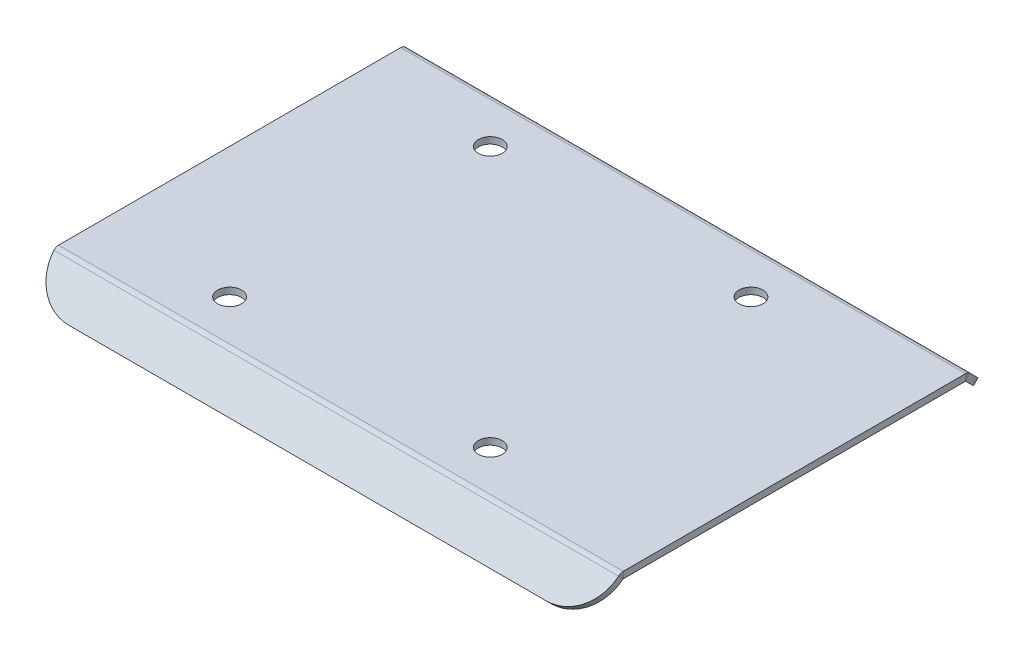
ISO-10303-21;
HEADER;
FILE_DESCRIPTION(('STEP AP214'),'2;1');
FILE_NAME('part.step','',(''),(''),'','','');
FILE_SCHEMA(('AUTOMOTIVE_DESIGN { 1 0 10303 214 1 1 1 1 }'));
ENDSEC;
DATA;
#1=APPLICATION_CONTEXT('core data for automotive mechanical design processes');
#2=APPLICATION_PROTOCOL_DEFINITION('international standard','automotive_design',2000,#1);
#3=PRODUCT_CONTEXT('',#1,'mechanical');
#4=PRODUCT('Part','Part','',(#3));
#5=PRODUCT_RELATED_PRODUCT_CATEGORY('part','',(#4));
#6=PRODUCT_DEFINITION_FORMATION('','',#4);
#7=PRODUCT_DEFINITION_CONTEXT('part definition',#1,'design');
#8=PRODUCT_DEFINITION('design','',#6,#7);
#9=PRODUCT_DEFINITION_SHAPE('','',#8);
#10=(LENGTH_UNIT() NAMED_UNIT(*) SI_UNIT(.MILLI.,.METRE.));
#11=(NAMED_UNIT(*) PLANE_ANGLE_UNIT() SI_UNIT($,.RADIAN.));
#12=(NAMED_UNIT(*) SI_UNIT($,.STERADIAN.) SOLID_ANGLE_UNIT());
#13=UNCERTAINTY_MEASURE_WITH_UNIT(LENGTH_MEASURE(1.E-05),#10,'distance_accuracy_value','');
#14=(GEOMETRIC_REPRESENTATION_CONTEXT(3) GLOBAL_UNCERTAINTY_ASSIGNED_CONTEXT((#13)) GLOBAL_UNIT_ASSIGNED_CONTEXT((#10,
#11,#12)) REPRESENTATION_CONTEXT('',''));
#15=CARTESIAN_POINT('',(0.,0.,0.));
#16=DIRECTION('',(0.,0.,1.));
#17=DIRECTION('',(1.,0.,0.));
#18=AXIS2_PLACEMENT_3D('',#15,#16,#17);
#19=CARTESIAN_POINT('',(130.,1.5,-9.26230100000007));
#20=DIRECTION('',(-1.,0.,0.));
#21=DIRECTION('',(0.,0.,1.));
#22=AXIS2_PLACEMENT_3D('',#19,#20,#21);
#23=PLANE('',#22);
#24=DIRECTION('',(0.,0.,-1.));
#25=VECTOR('',#24,1.);
#26=CARTESIAN_POINT('',(130.,1.5,-9.26230100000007));
#27=LINE('',#26,#25);
#28=CARTESIAN_POINT('',(130.,1.49999999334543,-9.88276347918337));
#29=VERTEX_POINT('',#28);
#30=CARTESIAN_POINT('',(130.,1.5,-88.6418385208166));
#31=VERTEX_POINT('',#30);
#32=EDGE_CURVE('E527',#29,#31,#27,.T.);
#33=ORIENTED_EDGE('',*,*,#32,.F.);
#34=DIRECTION('',(0.,-1.,0.));
#35=VECTOR('',#34,1.);
#36=CARTESIAN_POINT('',(130.,1.5,-9.88276347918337));
#37=LINE('',#36,#35);
#38=CARTESIAN_POINT('',(130.,0.,-9.88276347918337));
#39=VERTEX_POINT('',#38);
#40=EDGE_CURVE('E12',#29,#39,#37,.T.);
#41=ORIENTED_EDGE('',*,*,#40,.T.);
#42=DIRECTION('',(0.,0.,-1.));
#43=VECTOR('',#42,1.);
#44=CARTESIAN_POINT('',(130.,0.,-9.26230100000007));
#45=LINE('',#44,#43);
#46=CARTESIAN_POINT('',(130.,0.,-88.6418385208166));
#47=VERTEX_POINT('',#46);
#48=EDGE_CURVE('E591',#39,#47,#45,.T.);
#49=ORIENTED_EDGE('',*,*,#48,.T.);
#50=DIRECTION('',(0.,-1.,0.));
#51=VECTOR('',#50,1.);
#52=CARTESIAN_POINT('',(130.,1.5,-88.6418385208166));
#53=LINE('',#52,#51);
#54=EDGE_CURVE('E526',#31,#47,#53,.T.);
#55=ORIENTED_EDGE('',*,*,#54,.F.);
#56=EDGE_LOOP('',(#33,#41,#49,#55));
#57=FACE_BOUND('',#56,.T.);
#58=ADVANCED_FACE('F66',(#57),#23,.F.);
#59=CARTESIAN_POINT('',(0.,1.5,-89.2623009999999));
#60=DIRECTION('',(1.,0.,0.));
#61=DIRECTION('',(0.,0.,-1.));
#62=AXIS2_PLACEMENT_3D('',#59,#60,#61);
#63=PLANE('',#62);
#64=DIRECTION('',(0.,0.,1.));
#65=VECTOR('',#64,1.);
#66=CARTESIAN_POINT('',(0.,0.,-89.2623009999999));
#67=LINE('',#66,#65);
#68=CARTESIAN_POINT('',(0.,0.,-88.6418385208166));
#69=VERTEX_POINT('',#68);
#70=CARTESIAN_POINT('',(0.,-6.91786580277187E-09,-9.88276347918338));
#71=VERTEX_POINT('',#70);
#72=EDGE_CURVE('E93',#69,#71,#67,.T.);
#73=ORIENTED_EDGE('',*,*,#72,.T.);
#74=DIRECTION('',(0.,1.,0.));
#75=VECTOR('',#74,1.);
#76=CARTESIAN_POINT('',(0.,1.5,-9.88276347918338));
#77=LINE('',#76,#75);
#78=CARTESIAN_POINT('',(0.,1.49999999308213,-9.88276347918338));
#79=VERTEX_POINT('',#78);
#80=EDGE_CURVE('E587',#71,#79,#77,.T.);
#81=ORIENTED_EDGE('',*,*,#80,.T.);
#82=DIRECTION('',(0.,0.,1.));
#83=VECTOR('',#82,1.);
#84=CARTESIAN_POINT('',(0.,1.5,-89.2623009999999));
#85=LINE('',#84,#83);
#86=CARTESIAN_POINT('',(0.,1.50000005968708,-88.6418385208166));
#87=VERTEX_POINT('',#86);
#88=EDGE_CURVE('E593',#87,#79,#85,.T.);
#89=ORIENTED_EDGE('',*,*,#88,.F.);
#90=DIRECTION('',(0.,1.,0.));
#91=VECTOR('',#90,1.);
#92=CARTESIAN_POINT('',(0.,1.5,-88.6418385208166));
#93=LINE('',#92,#91);
#94=EDGE_CURVE('E532',#69,#87,#93,.T.);
#95=ORIENTED_EDGE('',*,*,#94,.F.);
#96=EDGE_LOOP('',(#73,#81,#89,#95));
#97=FACE_BOUND('',#96,.T.);
#98=ADVANCED_FACE('F633',(#97),#63,.F.);
#99=CARTESIAN_POINT('',(9.99999999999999,1.5,-89.262301));
#100=DIRECTION('',(0.,-1.,0.));
#101=DIRECTION('',(0.,0.,-1.));
#102=AXIS2_PLACEMENT_3D('',#99,#100,#101);
#103=PLANE('',#102);
#104=CARTESIAN_POINT('',(90.,1.5,-19.262301));
#105=DIRECTION('',(0.,1.,0.));
#106=DIRECTION('',(0.,0.,1.));
#107=AXIS2_PLACEMENT_3D('',#104,#105,#106);
#108=CIRCLE('',#107,2.75000000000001);
#109=CARTESIAN_POINT('',(90.,1.5,-16.512301));
#110=VERTEX_POINT('',#109);
#111=EDGE_CURVE('E502',#110,#110,#108,.T.);
#112=ORIENTED_EDGE('',*,*,#111,.F.);
#113=EDGE_LOOP('',(#112));
#114=FACE_BOUND('',#113,.T.);
#115=CARTESIAN_POINT('',(90.,1.5,-79.262301));
#116=DIRECTION('',(0.,1.,0.));
#117=DIRECTION('',(0.,0.,1.));
#118=AXIS2_PLACEMENT_3D('',#115,#116,#117);
#119=CIRCLE('',#118,2.75000000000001);
#120=CARTESIAN_POINT('',(90.,1.5,-76.512301));
#121=VERTEX_POINT('',#120);
#122=EDGE_CURVE('E514',#121,#121,#119,.T.);
#123=ORIENTED_EDGE('',*,*,#122,.F.);
#124=EDGE_LOOP('',(#123));
#125=FACE_BOUND('',#124,.T.);
#126=CARTESIAN_POINT('',(30.,1.5,-79.262301));
#127=DIRECTION('',(0.,1.,0.));
#128=DIRECTION('',(0.,0.,1.));
#129=AXIS2_PLACEMENT_3D('',#126,#127,#128);
#130=CIRCLE('',#129,2.75);
#131=CARTESIAN_POINT('',(30.,1.5,-76.512301));
#132=VERTEX_POINT('',#131);
#133=EDGE_CURVE('E520',#132,#132,#130,.T.);
#134=ORIENTED_EDGE('',*,*,#133,.F.);
#135=EDGE_LOOP('',(#134));
#136=FACE_BOUND('',#135,.T.);
#137=CARTESIAN_POINT('',(30.,1.5,-19.262301));
#138=DIRECTION('',(0.,1.,0.));
#139=DIRECTION('',(0.,0.,1.));
#140=AXIS2_PLACEMENT_3D('',#137,#138,#139);
#141=CIRCLE('',#140,2.75);
#142=CARTESIAN_POINT('',(30.,1.5,-16.512301));
#143=VERTEX_POINT('',#142);
#144=EDGE_CURVE('E508',#143,#143,#141,.T.);
#145=ORIENTED_EDGE('',*,*,#144,.F.);
#146=EDGE_LOOP('',(#145));
#147=FACE_BOUND('',#146,.T.);
#148=ORIENTED_EDGE('',*,*,#88,.T.);
#149=DIRECTION('',(1.,0.,0.));
#150=VECTOR('',#149,1.);
#151=CARTESIAN_POINT('',(9.99999999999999,1.5,-9.88276347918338));
#152=LINE('',#151,#150);
#153=EDGE_CURVE('E535',#79,#29,#152,.T.);
#154=ORIENTED_EDGE('',*,*,#153,.T.);
#155=ORIENTED_EDGE('',*,*,#32,.T.);
#156=DIRECTION('',(1.,0.,0.));
#157=VECTOR('',#156,1.);
#158=CARTESIAN_POINT('',(9.99999999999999,1.5,-88.6418385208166));
#159=LINE('',#158,#157);
#160=EDGE_CURVE('E523',#87,#31,#159,.T.);
#161=ORIENTED_EDGE('',*,*,#160,.F.);
#162=EDGE_LOOP('',(#148,#154,#155,#161));
#163=FACE_BOUND('',#162,.T.);
#164=ADVANCED_FACE('F639',(#114,#125,#136,#147,#163),#103,.F.);
#165=CARTESIAN_POINT('',(9.99999999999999,0.,-89.262301));
#166=DIRECTION('',(0.,-1.,0.));
#167=DIRECTION('',(0.,0.,-1.));
#168=AXIS2_PLACEMENT_3D('',#165,#166,#167);
#169=PLANE('',#168);
#170=DIRECTION('',(1.,0.,0.));
#171=VECTOR('',#170,1.);
#172=CARTESIAN_POINT('',(9.99999999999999,0.,-9.88276347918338));
#173=LINE('',#172,#171);
#174=EDGE_CURVE('E77',#71,#39,#173,.T.);
#175=ORIENTED_EDGE('',*,*,#174,.F.);
#176=ORIENTED_EDGE('',*,*,#72,.F.);
#177=DIRECTION('',(1.,0.,0.));
#178=VECTOR('',#177,1.);
#179=CARTESIAN_POINT('',(9.99999999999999,0.,-88.6418385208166));
#180=LINE('',#179,#178);
#181=EDGE_CURVE('E530',#69,#47,#180,.T.);
#182=ORIENTED_EDGE('',*,*,#181,.T.);
#183=ORIENTED_EDGE('',*,*,#48,.F.);
#184=EDGE_LOOP('',(#175,#176,#182,#183));
#185=FACE_BOUND('',#184,.T.);
#186=CARTESIAN_POINT('',(30.,0.,-19.262301));
#187=DIRECTION('',(0.,1.,0.));
#188=DIRECTION('',(0.,0.,1.));
#189=AXIS2_PLACEMENT_3D('',#186,#187,#188);
#190=CIRCLE('',#189,2.75);
#191=CARTESIAN_POINT('',(30.,0.,-16.512301));
#192=VERTEX_POINT('',#191);
#193=EDGE_CURVE('E505',#192,#192,#190,.T.);
#194=ORIENTED_EDGE('',*,*,#193,.T.);
#195=EDGE_LOOP('',(#194));
#196=FACE_BOUND('',#195,.T.);
#197=CARTESIAN_POINT('',(30.,0.,-79.262301));
#198=DIRECTION('',(0.,1.,0.));
#199=DIRECTION('',(0.,0.,1.));
#200=AXIS2_PLACEMENT_3D('',#197,#198,#199);
#201=CIRCLE('',#200,2.75);
#202=CARTESIAN_POINT('',(30.,0.,-76.512301));
#203=VERTEX_POINT('',#202);
#204=EDGE_CURVE('E517',#203,#203,#201,.T.);
#205=ORIENTED_EDGE('',*,*,#204,.T.);
#206=EDGE_LOOP('',(#205));
#207=FACE_BOUND('',#206,.T.);
#208=CARTESIAN_POINT('',(90.,0.,-79.262301));
#209=DIRECTION('',(0.,1.,0.));
#210=DIRECTION('',(0.,0.,1.));
#211=AXIS2_PLACEMENT_3D('',#208,#209,#210);
#212=CIRCLE('',#211,2.75000000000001);
#213=CARTESIAN_POINT('',(90.,0.,-76.512301));
#214=VERTEX_POINT('',#213);
#215=EDGE_CURVE('E511',#214,#214,#212,.T.);
#216=ORIENTED_EDGE('',*,*,#215,.T.);
#217=EDGE_LOOP('',(#216));
#218=FACE_BOUND('',#217,.T.);
#219=CARTESIAN_POINT('',(90.,0.,-19.262301));
#220=DIRECTION('',(0.,1.,0.));
#221=DIRECTION('',(0.,0.,1.));
#222=AXIS2_PLACEMENT_3D('',#219,#220,#221);
#223=CIRCLE('',#222,2.75000000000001);
#224=CARTESIAN_POINT('',(90.,0.,-16.512301));
#225=VERTEX_POINT('',#224);
#226=EDGE_CURVE('E494',#225,#225,#223,.T.);
#227=ORIENTED_EDGE('',*,*,#226,.T.);
#228=EDGE_LOOP('',(#227));
#229=FACE_BOUND('',#228,.T.);
#230=ADVANCED_FACE('F68',(#185,#196,#207,#218,#229),#169,.T.);
#231=CARTESIAN_POINT('',(30.,1.5,-79.262301));
#232=DIRECTION('',(0.,-1.,0.));
#233=DIRECTION('',(0.,0.,-1.));
#234=AXIS2_PLACEMENT_3D('',#231,#232,#233);
#235=CYLINDRICAL_SURFACE('',#234,2.75);
#236=ORIENTED_EDGE('',*,*,#133,.T.);
#237=EDGE_LOOP('',(#236));
#238=FACE_BOUND('',#237,.T.);
#239=ORIENTED_EDGE('',*,*,#204,.F.);
#240=EDGE_LOOP('',(#239));
#241=FACE_BOUND('',#240,.T.);
#242=ADVANCED_FACE('F649',(#238,#241),#235,.F.);
#243=CARTESIAN_POINT('',(90.,1.5,-79.262301));
#244=DIRECTION('',(0.,-1.,0.));
#245=DIRECTION('',(0.,0.,-1.));
#246=AXIS2_PLACEMENT_3D('',#243,#244,#245);
#247=CYLINDRICAL_SURFACE('',#246,2.75000000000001);
#248=ORIENTED_EDGE('',*,*,#122,.T.);
#249=EDGE_LOOP('',(#248));
#250=FACE_BOUND('',#249,.T.);
#251=ORIENTED_EDGE('',*,*,#215,.F.);
#252=EDGE_LOOP('',(#251));
#253=FACE_BOUND('',#252,.T.);
#254=ADVANCED_FACE('F767',(#250,#253),#247,.F.);
#255=CARTESIAN_POINT('',(30.,1.5,-19.262301));
#256=DIRECTION('',(0.,-1.,0.));
#257=DIRECTION('',(0.,0.,-1.));
#258=AXIS2_PLACEMENT_3D('',#255,#256,#257);
#259=CYLINDRICAL_SURFACE('',#258,2.75);
#260=ORIENTED_EDGE('',*,*,#144,.T.);
#261=EDGE_LOOP('',(#260));
#262=FACE_BOUND('',#261,.T.);
#263=ORIENTED_EDGE('',*,*,#193,.F.);
#264=EDGE_LOOP('',(#263));
#265=FACE_BOUND('',#264,.T.);
#266=ADVANCED_FACE('F762',(#262,#265),#259,.F.);
#267=CARTESIAN_POINT('',(90.,1.5,-19.262301));
#268=DIRECTION('',(0.,-1.,0.));
#269=DIRECTION('',(0.,0.,-1.));
#270=AXIS2_PLACEMENT_3D('',#267,#268,#269);
#271=CYLINDRICAL_SURFACE('',#270,2.75000000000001);
#272=ORIENTED_EDGE('',*,*,#111,.T.);
#273=EDGE_LOOP('',(#272));
#274=FACE_BOUND('',#273,.T.);
#275=ORIENTED_EDGE('',*,*,#226,.F.);
#276=EDGE_LOOP('',(#275));
#277=FACE_BOUND('',#276,.T.);
#278=ADVANCED_FACE('F453',(#274,#277),#271,.F.);
#279=CARTESIAN_POINT('',(0.,-0.0100000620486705,-88.6418385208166));
#280=DIRECTION('',(-1.,0.,0.));
#281=DIRECTION('',(0.,0.,1.));
#282=AXIS2_PLACEMENT_3D('',#279,#280,#281);
#283=PLANE('',#282);
#284=CARTESIAN_POINT('',(0.,-0.000761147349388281,-88.6456653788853));
#285=CARTESIAN_POINT('',(0.,1.38505815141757,-89.2196905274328));
#286=B_SPLINE_CURVE_WITH_KNOTS('',1,(#284,#285),.UNSPECIFIED.,.F.,.F.,(2,2),(0.,1.),.UNSPECIFIED.);
#287=CARTESIAN_POINT('',(0.,-0.00076114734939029,-88.6456653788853));
#288=VERTEX_POINT('',#287);
#289=CARTESIAN_POINT('',(0.,1.38505815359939,-89.2196905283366));
#290=VERTEX_POINT('',#289);
#291=EDGE_CURVE('E482',#288,#290,#286,.T.);
#292=ORIENTED_EDGE('',*,*,#291,.F.);
#293=CARTESIAN_POINT('',(0.,-0.01,-88.6418385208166));
#294=DIRECTION('',(-1.,0.,0.));
#295=DIRECTION('',(0.,0.,1.));
#296=AXIS2_PLACEMENT_3D('',#293,#294,#295);
#297=CIRCLE('',#296,0.0100000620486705);
#298=EDGE_CURVE('E359',#288,#69,#297,.F.);
#299=ORIENTED_EDGE('',*,*,#298,.T.);
#300=ORIENTED_EDGE('',*,*,#94,.T.);
#301=CARTESIAN_POINT('',(0.,-0.0100000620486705,-88.6418385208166));
#302=DIRECTION('',(1.,0.,0.));
#303=DIRECTION('',(0.,0.,-1.));
#304=AXIS2_PLACEMENT_3D('',#301,#302,#303);
#305=CIRCLE('',#304,1.51000012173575);
#306=EDGE_CURVE('E686',#290,#87,#305,.T.);
#307=ORIENTED_EDGE('',*,*,#306,.F.);
#308=EDGE_LOOP('',(#292,#299,#300,#307));
#309=FACE_BOUND('',#308,.T.);
#310=ADVANCED_FACE('F451',(#309),#283,.T.);
#311=CARTESIAN_POINT('',(130.,-0.0100000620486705,-88.6418385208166));
#312=DIRECTION('',(1.,0.,0.));
#313=DIRECTION('',(0.,0.,-1.));
#314=AXIS2_PLACEMENT_3D('',#311,#312,#313);
#315=PLANE('',#314);
#316=ORIENTED_EDGE('',*,*,#54,.T.);
#317=CARTESIAN_POINT('',(130.,-0.01,-88.6418385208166));
#318=DIRECTION('',(-1.,0.,0.));
#319=DIRECTION('',(0.,0.,1.));
#320=AXIS2_PLACEMENT_3D('',#317,#318,#319);
#321=CIRCLE('',#320,0.0100000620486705);
#322=CARTESIAN_POINT('',(130.,-0.000761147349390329,-88.6456653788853));
#323=VERTEX_POINT('',#322);
#324=EDGE_CURVE('E692',#47,#323,#321,.T.);
#325=ORIENTED_EDGE('',*,*,#324,.T.);
#326=CARTESIAN_POINT('',(130.,1.38505815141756,-89.2196905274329));
#327=CARTESIAN_POINT('',(130.,-0.000761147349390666,-88.6456653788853));
#328=B_SPLINE_CURVE_WITH_KNOTS('',1,(#326,#327),.UNSPECIFIED.,.F.,.F.,(2,2),(0.,1.),.UNSPECIFIED.);
#329=CARTESIAN_POINT('',(130.,1.38505815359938,-89.2196905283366));
#330=VERTEX_POINT('',#329);
#331=EDGE_CURVE('E680',#323,#330,#328,.F.);
#332=ORIENTED_EDGE('',*,*,#331,.T.);
#333=CARTESIAN_POINT('',(130.,-0.0100000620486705,-88.6418385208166));
#334=DIRECTION('',(-1.,0.,0.));
#335=DIRECTION('',(0.,0.,1.));
#336=AXIS2_PLACEMENT_3D('',#333,#334,#335);
#337=CIRCLE('',#336,1.51000012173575);
#338=EDGE_CURVE('E678',#31,#330,#337,.T.);
#339=ORIENTED_EDGE('',*,*,#338,.F.);
#340=EDGE_LOOP('',(#316,#325,#332,#339));
#341=FACE_BOUND('',#340,.T.);
#342=ADVANCED_FACE('F730',(#341),#315,.T.);
#343=CARTESIAN_POINT('',(130.,1.38505815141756,-89.2196905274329));
#344=CARTESIAN_POINT('',(129.993573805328,1.30937298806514,-89.4024106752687));
#345=CARTESIAN_POINT('',(129.987158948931,1.19757923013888,-89.5697218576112));
#346=CARTESIAN_POINT('',(129.980732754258,1.05773128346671,-89.7095698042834));
#347=CARTESIAN_POINT('',(130.,-0.000761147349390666,-88.6456653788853));
#348=CARTESIAN_POINT('',(129.993577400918,-0.00126209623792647,-88.6468747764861));
#349=CARTESIAN_POINT('',(129.987155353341,-0.00200325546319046,-88.6479839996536));
#350=CARTESIAN_POINT('',(129.980732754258,-0.00292888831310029,-88.6489096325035));
#351=B_SPLINE_SURFACE_WITH_KNOTS('',1,3,((#343,#344,#345,#346),(#347,#348,#349,#350)),
.UNSPECIFIED.,.F.,.F.,.F.,(2,2),(4,4),(0.,1.),(0.,1.),.UNSPECIFIED.);
#352=CARTESIAN_POINT('',(130.,-0.000761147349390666,-88.6456653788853));
#353=CARTESIAN_POINT('',(129.993577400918,-0.00126209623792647,-88.6468747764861));
#354=CARTESIAN_POINT('',(129.987155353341,-0.00200325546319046,-88.6479839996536));
#355=CARTESIAN_POINT('',(129.980732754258,-0.00292888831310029,-88.6489096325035));
#356=B_SPLINE_CURVE_WITH_KNOTS('',3,(#352,#353,#354,#355),.UNSPECIFIED.,.F.,.F.,(4,4),(0.,1.),.UNSPECIFIED.);
#357=CARTESIAN_POINT('',(129.980732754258,-0.00292893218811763,-88.6489095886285));
#358=VERTEX_POINT('',#357);
#359=EDGE_CURVE('E687',#323,#358,#356,.T.);
#360=CARTESIAN_POINT('',(129.980732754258,-0.00292888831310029,-88.6489096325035));
#361=CARTESIAN_POINT('',(129.980732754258,1.05773128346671,-89.7095698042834));
#362=B_SPLINE_CURVE_WITH_KNOTS('',1,(#360,#361),.UNSPECIFIED.,.F.,.F.,(2,2),(0.,1.),.UNSPECIFIED.);
#363=CARTESIAN_POINT('',(129.980732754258,1.0577312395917,-89.7095697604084));
#364=VERTEX_POINT('',#363);
#365=EDGE_CURVE('E363',#364,#358,#362,.F.);
#366=CARTESIAN_POINT('',(129.980732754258,1.05773128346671,-89.7095698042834));
#367=CARTESIAN_POINT('',(129.987158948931,1.19757923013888,-89.5697218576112));
#368=CARTESIAN_POINT('',(129.993573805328,1.30937298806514,-89.4024106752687));
#369=CARTESIAN_POINT('',(130.,1.38505815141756,-89.2196905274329));
#370=B_SPLINE_CURVE_WITH_KNOTS('',3,(#366,#367,#368,#369),.UNSPECIFIED.,.F.,.F.,(4,4),(0.,1.),.UNSPECIFIED.);
#371=EDGE_CURVE('E675',#330,#364,#370,.F.);
#372=ORIENTED_EDGE('',*,*,#331,.F.);
#373=ORIENTED_EDGE('',*,*,#359,.T.);
#374=ORIENTED_EDGE('',*,*,#365,.F.);
#375=ORIENTED_EDGE('',*,*,#371,.F.);
#376=EDGE_LOOP('',(#372,#373,#374,#375));
#377=FACE_BOUND('',#376,.T.);
#378=ADVANCED_FACE('F391',(#377),#351,.T.);
#379=CARTESIAN_POINT('',(0.0192672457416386,1.05773128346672,-89.7095698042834));
#380=CARTESIAN_POINT('',(0.0128410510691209,1.1975792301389,-89.5697218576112));
#381=CARTESIAN_POINT('',(0.00642619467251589,1.30937298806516,-89.4024106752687));
#382=CARTESIAN_POINT('',(0.,1.38505815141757,-89.2196905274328));
#383=CARTESIAN_POINT('',(0.0192672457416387,-0.00292888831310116,-88.6489096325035));
#384=CARTESIAN_POINT('',(0.0128446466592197,-0.00200325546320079,-88.6479839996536));
#385=CARTESIAN_POINT('',(0.00642259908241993,-0.00126209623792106,-88.646874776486));
#386=CARTESIAN_POINT('',(0.,-0.000761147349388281,-88.6456653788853));
#387=B_SPLINE_SURFACE_WITH_KNOTS('',1,3,((#379,#380,#381,#382),(#383,#384,#385,#386)),
.UNSPECIFIED.,.F.,.F.,.F.,(2,2),(4,4),(0.,1.),(0.,1.),.UNSPECIFIED.);
#388=CARTESIAN_POINT('',(0.0192672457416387,-0.00292888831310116,-88.6489096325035));
#389=CARTESIAN_POINT('',(0.0128446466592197,-0.00200325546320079,-88.6479839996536));
#390=CARTESIAN_POINT('',(0.00642259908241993,-0.00126209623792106,-88.646874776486));
#391=CARTESIAN_POINT('',(0.,-0.000761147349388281,-88.6456653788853));
#392=B_SPLINE_CURVE_WITH_KNOTS('',3,(#388,#389,#390,#391),.UNSPECIFIED.,.F.,.F.,(4,4),(0.,1.),.UNSPECIFIED.);
#393=CARTESIAN_POINT('',(0.0192672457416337,-0.00292893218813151,-88.6489095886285));
#394=VERTEX_POINT('',#393);
#395=EDGE_CURVE('E423',#394,#288,#392,.T.);
#396=CARTESIAN_POINT('',(0.,1.38505815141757,-89.2196905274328));
#397=CARTESIAN_POINT('',(0.00642619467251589,1.30937298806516,-89.4024106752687));
#398=CARTESIAN_POINT('',(0.0128410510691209,1.1975792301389,-89.5697218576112));
#399=CARTESIAN_POINT('',(0.0192672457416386,1.05773128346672,-89.7095698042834));
#400=B_SPLINE_CURVE_WITH_KNOTS('',3,(#396,#397,#398,#399),.UNSPECIFIED.,.F.,.F.,(4,4),(0.,1.),.UNSPECIFIED.);
#401=CARTESIAN_POINT('',(0.0192672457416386,1.05773128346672,-89.7095698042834));
#402=VERTEX_POINT('',#401);
#403=EDGE_CURVE('E416',#402,#290,#400,.F.);
#404=CARTESIAN_POINT('',(0.0192672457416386,1.05773128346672,-89.7095698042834));
#405=CARTESIAN_POINT('',(0.0192672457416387,-0.00292888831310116,-88.6489096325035));
#406=B_SPLINE_CURVE_WITH_KNOTS('',1,(#404,#405),.UNSPECIFIED.,.F.,.F.,(2,2),(0.,1.),.UNSPECIFIED.);
#407=EDGE_CURVE('E360',#394,#402,#406,.F.);
#408=ORIENTED_EDGE('',*,*,#395,.T.);
#409=ORIENTED_EDGE('',*,*,#291,.T.);
#410=ORIENTED_EDGE('',*,*,#403,.F.);
#411=ORIENTED_EDGE('',*,*,#407,.F.);
#412=EDGE_LOOP('',(#408,#409,#410,#411));
#413=FACE_BOUND('',#412,.T.);
#414=ADVANCED_FACE('F389',(#413),#387,.T.);
#415=CARTESIAN_POINT('',(195.014575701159,-0.01,-88.6418385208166));
#416=DIRECTION('',(-1.,0.,0.));
#417=DIRECTION('',(0.,0.,1.));
#418=AXIS2_PLACEMENT_3D('',#415,#416,#417);
#419=CYLINDRICAL_SURFACE('',#418,1.51000006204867);
#420=DIRECTION('',(1.,0.,0.));
#421=VECTOR('',#420,1.);
#422=CARTESIAN_POINT('',(9.99999999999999,1.05773123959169,-89.7095697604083));
#423=LINE('',#422,#421);
#424=EDGE_CURVE('E538',#402,#364,#423,.T.);
#425=ORIENTED_EDGE('',*,*,#424,.F.);
#426=ORIENTED_EDGE('',*,*,#403,.T.);
#427=ORIENTED_EDGE('',*,*,#306,.T.);
#428=ORIENTED_EDGE('',*,*,#160,.T.);
#429=ORIENTED_EDGE('',*,*,#338,.T.);
#430=ORIENTED_EDGE('',*,*,#371,.T.);
#431=EDGE_LOOP('',(#425,#426,#427,#428,#429,#430));
#432=FACE_BOUND('',#431,.T.);
#433=ADVANCED_FACE('F378',(#432),#419,.T.);
#434=CARTESIAN_POINT('',(195.014575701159,-0.01,-88.6418385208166));
#435=DIRECTION('',(-1.,0.,0.));
#436=DIRECTION('',(0.,0.,1.));
#437=AXIS2_PLACEMENT_3D('',#434,#435,#436);
#438=CYLINDRICAL_SURFACE('',#437,0.0100000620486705);
#439=DIRECTION('',(1.,0.,0.));
#440=VECTOR('',#439,1.);
#441=CARTESIAN_POINT('',(9.99999999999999,-0.00292893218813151,-88.6489095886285));
#442=LINE('',#441,#440);
#443=EDGE_CURVE('E371',#394,#358,#442,.T.);
#444=ORIENTED_EDGE('',*,*,#443,.T.);
#445=ORIENTED_EDGE('',*,*,#359,.F.);
#446=ORIENTED_EDGE('',*,*,#324,.F.);
#447=ORIENTED_EDGE('',*,*,#181,.F.);
#448=ORIENTED_EDGE('',*,*,#298,.F.);
#449=ORIENTED_EDGE('',*,*,#395,.F.);
#450=EDGE_LOOP('',(#444,#445,#446,#447,#448,#449));
#451=FACE_BOUND('',#450,.T.);
#452=ADVANCED_FACE('F388',(#451),#438,.F.);
#453=CARTESIAN_POINT('',(120.,-5.57460334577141,-96.3419043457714));
#454=DIRECTION('',(0.,0.707106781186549,0.707106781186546));
#455=DIRECTION('',(1.,0.,0.));
#456=AXIS2_PLACEMENT_3D('',#453,#454,#455);
#457=PLANE('',#456);
#458=DIRECTION('',(-1.,0.,0.));
#459=VECTOR('',#458,1.);
#460=CARTESIAN_POINT('',(120.,-6.63526351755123,-95.2812441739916));
#461=LINE('',#460,#459);
#462=CARTESIAN_POINT('',(120.,-6.63526351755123,-95.2812441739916));
#463=VERTEX_POINT('',#462);
#464=CARTESIAN_POINT('',(10.0000000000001,-6.63526351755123,-95.2812441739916));
#465=VERTEX_POINT('',#464);
#466=EDGE_CURVE('E369',#463,#465,#461,.T.);
#467=ORIENTED_EDGE('',*,*,#466,.T.);
#468=DIRECTION('',(0.,-0.707106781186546,0.707106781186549));
#469=VECTOR('',#468,1.);
#470=CARTESIAN_POINT('',(10.0000000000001,-5.57460334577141,-96.3419043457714));
#471=LINE('',#470,#469);
#472=CARTESIAN_POINT('',(10.0000000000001,-5.57460334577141,-96.3419043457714));
#473=VERTEX_POINT('',#472);
#474=EDGE_CURVE('E351',#473,#465,#471,.T.);
#475=ORIENTED_EDGE('',*,*,#474,.F.);
#476=DIRECTION('',(-1.,0.,0.));
#477=VECTOR('',#476,1.);
#478=CARTESIAN_POINT('',(120.,-5.57460334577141,-96.3419043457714));
#479=LINE('',#478,#477);
#480=CARTESIAN_POINT('',(120.,-5.57460334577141,-96.3419043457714));
#481=VERTEX_POINT('',#480);
#482=EDGE_CURVE('E361',#481,#473,#479,.T.);
#483=ORIENTED_EDGE('',*,*,#482,.F.);
#484=DIRECTION('',(0.,-0.707106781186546,0.707106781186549));
#485=VECTOR('',#484,1.);
#486=CARTESIAN_POINT('',(120.,-5.57460334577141,-96.3419043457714));
#487=LINE('',#486,#485);
#488=EDGE_CURVE('E365',#481,#463,#487,.T.);
#489=ORIENTED_EDGE('',*,*,#488,.T.);
#490=EDGE_LOOP('',(#467,#475,#483,#489));
#491=FACE_BOUND('',#490,.T.);
#492=ADVANCED_FACE('F865',(#491),#457,.F.);
#493=CARTESIAN_POINT('',(9.99999999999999,1.49646446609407,-89.2708365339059));
#494=DIRECTION('',(0.,-0.707106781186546,0.707106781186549));
#495=DIRECTION('',(0.,-0.707106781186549,-0.707106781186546));
#496=AXIS2_PLACEMENT_3D('',#493,#494,#495);
#497=PLANE('',#496);
#498=CARTESIAN_POINT('',(9.99999999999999,1.49646446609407,-89.2708365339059));
#499=DIRECTION('',(0.,0.707106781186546,-0.707106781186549));
#500=DIRECTION('',(0.,-0.707106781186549,-0.707106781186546));
#501=AXIS2_PLACEMENT_3D('',#498,#499,#500);
#502=CIRCLE('',#501,10.);
#503=EDGE_CURVE('E368',#473,#402,#502,.T.);
#504=ORIENTED_EDGE('',*,*,#503,.T.);
#505=ORIENTED_EDGE('',*,*,#424,.T.);
#506=CARTESIAN_POINT('',(120.,1.49646446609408,-89.270836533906));
#507=DIRECTION('',(0.,0.707106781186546,-0.707106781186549));
#508=DIRECTION('',(0.,-0.707106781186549,-0.707106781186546));
#509=AXIS2_PLACEMENT_3D('',#506,#507,#508);
#510=CIRCLE('',#509,9.99999999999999);
#511=EDGE_CURVE('E364',#364,#481,#510,.T.);
#512=ORIENTED_EDGE('',*,*,#511,.T.);
#513=ORIENTED_EDGE('',*,*,#482,.T.);
#514=EDGE_LOOP('',(#504,#505,#512,#513));
#515=FACE_BOUND('',#514,.T.);
#516=ADVANCED_FACE('F568',(#515),#497,.F.);
#517=CARTESIAN_POINT('',(120.,1.49646446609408,-89.270836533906));
#518=DIRECTION('',(0.,-0.707106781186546,0.707106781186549));
#519=DIRECTION('',(0.,-0.707106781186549,-0.707106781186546));
#520=AXIS2_PLACEMENT_3D('',#517,#518,#519);
#521=CYLINDRICAL_SURFACE('',#520,9.99999999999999);
#522=ORIENTED_EDGE('',*,*,#511,.F.);
#523=ORIENTED_EDGE('',*,*,#365,.T.);
#524=CARTESIAN_POINT('',(120.,0.435804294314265,-88.2101763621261));
#525=DIRECTION('',(0.,0.707106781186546,-0.707106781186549));
#526=DIRECTION('',(0.,-0.707106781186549,-0.707106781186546));
#527=AXIS2_PLACEMENT_3D('',#524,#525,#526);
#528=CIRCLE('',#527,9.99999999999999);
#529=EDGE_CURVE('E735',#358,#463,#528,.T.);
#530=ORIENTED_EDGE('',*,*,#529,.T.);
#531=ORIENTED_EDGE('',*,*,#488,.F.);
#532=EDGE_LOOP('',(#522,#523,#530,#531));
#533=FACE_BOUND('',#532,.T.);
#534=ADVANCED_FACE('F557',(#533),#521,.T.);
#535=CARTESIAN_POINT('',(9.99999999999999,0.435804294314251,-88.2101763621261));
#536=DIRECTION('',(0.,-0.707106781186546,0.707106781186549));
#537=DIRECTION('',(0.,-0.707106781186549,-0.707106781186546));
#538=AXIS2_PLACEMENT_3D('',#535,#536,#537);
#539=PLANE('',#538);
#540=ORIENTED_EDGE('',*,*,#443,.F.);
#541=CARTESIAN_POINT('',(9.99999999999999,0.435804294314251,-88.2101763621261));
#542=DIRECTION('',(0.,0.707106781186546,-0.707106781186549));
#543=DIRECTION('',(0.,-0.707106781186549,-0.707106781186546));
#544=AXIS2_PLACEMENT_3D('',#541,#542,#543);
#545=CIRCLE('',#544,10.);
#546=EDGE_CURVE('E1074',#465,#394,#545,.T.);
#547=ORIENTED_EDGE('',*,*,#546,.F.);
#548=ORIENTED_EDGE('',*,*,#466,.F.);
#549=ORIENTED_EDGE('',*,*,#529,.F.);
#550=EDGE_LOOP('',(#540,#547,#548,#549));
#551=FACE_BOUND('',#550,.T.);
#552=ADVANCED_FACE('F567',(#551),#539,.T.);
#553=CARTESIAN_POINT('',(9.99999999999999,1.49646446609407,-89.2708365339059));
#554=DIRECTION('',(0.,-0.707106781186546,0.707106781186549));
#555=DIRECTION('',(0.,-0.707106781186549,-0.707106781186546));
#556=AXIS2_PLACEMENT_3D('',#553,#554,#555);
#557=CYLINDRICAL_SURFACE('',#556,10.);
#558=ORIENTED_EDGE('',*,*,#546,.T.);
#559=ORIENTED_EDGE('',*,*,#407,.T.);
#560=ORIENTED_EDGE('',*,*,#503,.F.);
#561=ORIENTED_EDGE('',*,*,#474,.T.);
#562=EDGE_LOOP('',(#558,#559,#560,#561));
#563=FACE_BOUND('',#562,.T.);
#564=ADVANCED_FACE('F307',(#563),#557,.T.);
#565=CARTESIAN_POINT('',(0.,1.38505808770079,-9.3049114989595));
#566=CARTESIAN_POINT('',(0.00642619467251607,1.30937292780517,-9.12219135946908));
#567=CARTESIAN_POINT('',(0.0128410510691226,1.19757917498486,-8.9548801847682));
#568=CARTESIAN_POINT('',(0.0192672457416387,1.05773123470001,-8.81503224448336));
#569=CARTESIAN_POINT('',(0.,-0.000761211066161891,-9.87893664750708));
#570=CARTESIAN_POINT('',(0.00642259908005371,-0.0012621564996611,-9.87772725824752));
#571=CARTESIAN_POINT('',(0.0128446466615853,-0.00200331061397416,-9.87661804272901));
#572=CARTESIAN_POINT('',(0.0192672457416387,-0.00292893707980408,-9.87569241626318));
#573=B_SPLINE_SURFACE_WITH_KNOTS('',1,3,((#565,#566,#567,#568),(#569,#570,#571,#572)),
.UNSPECIFIED.,.F.,.F.,.F.,(2,2),(4,4),(0.,1.),(0.,1.),.UNSPECIFIED.);
#574=CARTESIAN_POINT('',(0.,1.38505808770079,-9.3049114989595));
#575=CARTESIAN_POINT('',(0.,-0.000761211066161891,-9.87893664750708));
#576=B_SPLINE_CURVE_WITH_KNOTS('',1,(#574,#575),.UNSPECIFIED.,.F.,.F.,(2,2),(0.,1.),.UNSPECIFIED.);
#577=CARTESIAN_POINT('',(0.,-0.000761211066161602,-9.87893664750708));
#578=VERTEX_POINT('',#577);
#579=CARTESIAN_POINT('',(0.,1.38505808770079,-9.3049114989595));
#580=VERTEX_POINT('',#579);
#581=EDGE_CURVE('E339',#578,#580,#576,.F.);
#582=CARTESIAN_POINT('',(0.,-0.000761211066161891,-9.87893664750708));
#583=CARTESIAN_POINT('',(0.00642259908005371,-0.0012621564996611,-9.87772725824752));
#584=CARTESIAN_POINT('',(0.0128446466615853,-0.00200331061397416,-9.87661804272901));
#585=CARTESIAN_POINT('',(0.0192672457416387,-0.00292893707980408,-9.87569241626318));
#586=B_SPLINE_CURVE_WITH_KNOTS('',3,(#582,#583,#584,#585),.UNSPECIFIED.,.F.,.F.,(4,4),(0.,1.),.UNSPECIFIED.);
#587=CARTESIAN_POINT('',(0.0192672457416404,-0.00292893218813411,-9.87569241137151));
#588=VERTEX_POINT('',#587);
#589=EDGE_CURVE('E275',#578,#588,#586,.T.);
#590=CARTESIAN_POINT('',(0.0192672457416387,-0.00292893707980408,-9.87569241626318));
#591=CARTESIAN_POINT('',(0.0192672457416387,1.05773123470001,-8.81503224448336));
#592=B_SPLINE_CURVE_WITH_KNOTS('',1,(#590,#591),.UNSPECIFIED.,.F.,.F.,(2,2),(0.,1.),.UNSPECIFIED.);
#593=CARTESIAN_POINT('',(0.0192672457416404,1.05773123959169,-8.81503223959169));
#594=VERTEX_POINT('',#593);
#595=EDGE_CURVE('E192',#588,#594,#592,.T.);
#596=CARTESIAN_POINT('',(0.0192672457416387,1.05773123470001,-8.81503224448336));
#597=CARTESIAN_POINT('',(0.0128410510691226,1.19757917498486,-8.9548801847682));
#598=CARTESIAN_POINT('',(0.00642619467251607,1.30937292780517,-9.12219135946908));
#599=CARTESIAN_POINT('',(0.,1.38505808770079,-9.3049114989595));
#600=B_SPLINE_CURVE_WITH_KNOTS('',3,(#596,#597,#598,#599),.UNSPECIFIED.,.F.,.F.,(4,4),(0.,1.),.UNSPECIFIED.);
#601=EDGE_CURVE('E264',#580,#594,#600,.F.);
#602=ORIENTED_EDGE('',*,*,#581,.F.);
#603=ORIENTED_EDGE('',*,*,#589,.T.);
#604=ORIENTED_EDGE('',*,*,#595,.T.);
#605=ORIENTED_EDGE('',*,*,#601,.F.);
#606=EDGE_LOOP('',(#602,#603,#604,#605));
#607=FACE_BOUND('',#606,.T.);
#608=ADVANCED_FACE('F295',(#607),#573,.T.);
#609=CARTESIAN_POINT('',(129.980732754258,1.05773123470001,-8.81503224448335));
#610=CARTESIAN_POINT('',(129.987158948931,1.19757917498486,-8.95488018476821));
#611=CARTESIAN_POINT('',(129.993573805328,1.30937292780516,-9.12219135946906));
#612=CARTESIAN_POINT('',(130.,1.38505808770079,-9.3049114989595));
#613=CARTESIAN_POINT('',(129.980732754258,-0.00292893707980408,-9.87569241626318));
#614=CARTESIAN_POINT('',(129.987155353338,-0.00200331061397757,-9.87661804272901));
#615=CARTESIAN_POINT('',(129.99357740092,-0.00126215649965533,-9.87772725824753));
#616=CARTESIAN_POINT('',(130.,-0.000761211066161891,-9.87893664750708));
#617=B_SPLINE_SURFACE_WITH_KNOTS('',1,3,((#609,#610,#611,#612),(#613,#614,#615,#616)),
.UNSPECIFIED.,.F.,.F.,.F.,(2,2),(4,4),(0.,1.),(0.,1.),.UNSPECIFIED.);
#618=CARTESIAN_POINT('',(129.980732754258,1.05773123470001,-8.81503224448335));
#619=CARTESIAN_POINT('',(129.980732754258,-0.00292893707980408,-9.87569241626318));
#620=B_SPLINE_CURVE_WITH_KNOTS('',1,(#618,#619),.UNSPECIFIED.,.F.,.F.,(2,2),(0.,1.),.UNSPECIFIED.);
#621=CARTESIAN_POINT('',(129.980732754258,1.05773123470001,-8.81503224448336));
#622=VERTEX_POINT('',#621);
#623=CARTESIAN_POINT('',(129.980732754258,-0.00292893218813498,-9.87569241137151));
#624=VERTEX_POINT('',#623);
#625=EDGE_CURVE('E213',#622,#624,#620,.T.);
#626=CARTESIAN_POINT('',(129.980732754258,-0.00292893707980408,-9.87569241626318));
#627=CARTESIAN_POINT('',(129.987155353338,-0.00200331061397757,-9.87661804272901));
#628=CARTESIAN_POINT('',(129.99357740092,-0.00126215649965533,-9.87772725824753));
#629=CARTESIAN_POINT('',(130.,-0.000761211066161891,-9.87893664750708));
#630=B_SPLINE_CURVE_WITH_KNOTS('',3,(#626,#627,#628,#629),.UNSPECIFIED.,.F.,.F.,(4,4),(0.,1.),.UNSPECIFIED.);
#631=CARTESIAN_POINT('',(130.,-0.000761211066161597,-9.87893664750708));
#632=VERTEX_POINT('',#631);
#633=EDGE_CURVE('E218',#624,#632,#630,.T.);
#634=CARTESIAN_POINT('',(130.,-0.000761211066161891,-9.87893664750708));
#635=CARTESIAN_POINT('',(130.,1.38505808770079,-9.3049114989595));
#636=B_SPLINE_CURVE_WITH_KNOTS('',1,(#634,#635),.UNSPECIFIED.,.F.,.F.,(2,2),(0.,1.),.UNSPECIFIED.);
#637=CARTESIAN_POINT('',(130.,1.38505808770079,-9.3049114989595));
#638=VERTEX_POINT('',#637);
#639=EDGE_CURVE('E267',#632,#638,#636,.T.);
#640=CARTESIAN_POINT('',(130.,1.38505808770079,-9.3049114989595));
#641=CARTESIAN_POINT('',(129.993573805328,1.30937292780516,-9.12219135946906));
#642=CARTESIAN_POINT('',(129.987158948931,1.19757917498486,-8.95488018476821));
#643=CARTESIAN_POINT('',(129.980732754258,1.05773123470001,-8.81503224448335));
#644=B_SPLINE_CURVE_WITH_KNOTS('',3,(#640,#641,#642,#643),.UNSPECIFIED.,.F.,.F.,(4,4),(0.,1.),.UNSPECIFIED.);
#645=EDGE_CURVE('E669',#622,#638,#644,.F.);
#646=ORIENTED_EDGE('',*,*,#625,.T.);
#647=ORIENTED_EDGE('',*,*,#633,.T.);
#648=ORIENTED_EDGE('',*,*,#639,.T.);
#649=ORIENTED_EDGE('',*,*,#645,.F.);
#650=EDGE_LOOP('',(#646,#647,#648,#649));
#651=FACE_BOUND('',#650,.T.);
#652=ADVANCED_FACE('F306',(#651),#617,.T.);
#653=CARTESIAN_POINT('',(130.,-0.00999999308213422,-9.88276347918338));
#654=DIRECTION('',(1.,0.,0.));
#655=DIRECTION('',(0.,0.,-1.));
#656=AXIS2_PLACEMENT_3D('',#653,#654,#655);
#657=PLANE('',#656);
#658=ORIENTED_EDGE('',*,*,#639,.F.);
#659=CARTESIAN_POINT('',(130.,-0.01,-9.88276347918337));
#660=DIRECTION('',(1.,0.,0.));
#661=DIRECTION('',(0.,0.,-1.));
#662=AXIS2_PLACEMENT_3D('',#659,#660,#661);
#663=CIRCLE('',#662,0.00999999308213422);
#664=EDGE_CURVE('E85',#632,#39,#663,.F.);
#665=ORIENTED_EDGE('',*,*,#664,.T.);
#666=ORIENTED_EDGE('',*,*,#40,.F.);
#667=CARTESIAN_POINT('',(130.,-0.00999999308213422,-9.88276347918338));
#668=DIRECTION('',(-1.,0.,0.));
#669=DIRECTION('',(0.,0.,1.));
#670=AXIS2_PLACEMENT_3D('',#667,#668,#669);
#671=CIRCLE('',#670,1.50999998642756);
#672=EDGE_CURVE('E225',#638,#29,#671,.T.);
#673=ORIENTED_EDGE('',*,*,#672,.F.);
#674=EDGE_LOOP('',(#658,#665,#666,#673));
#675=FACE_BOUND('',#674,.T.);
#676=ADVANCED_FACE('F241',(#675),#657,.T.);
#677=CARTESIAN_POINT('',(0.,-0.00999999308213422,-9.88276347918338));
#678=DIRECTION('',(-1.,0.,0.));
#679=DIRECTION('',(0.,0.,1.));
#680=AXIS2_PLACEMENT_3D('',#677,#678,#679);
#681=PLANE('',#680);
#682=CARTESIAN_POINT('',(0.,-0.01,-9.88276347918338));
#683=DIRECTION('',(1.,0.,0.));
#684=DIRECTION('',(0.,0.,-1.));
#685=AXIS2_PLACEMENT_3D('',#682,#683,#684);
#686=CIRCLE('',#685,0.00999999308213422);
#687=EDGE_CURVE('E217',#71,#578,#686,.T.);
#688=ORIENTED_EDGE('',*,*,#687,.T.);
#689=ORIENTED_EDGE('',*,*,#581,.T.);
#690=CARTESIAN_POINT('',(0.,-0.00999999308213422,-9.88276347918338));
#691=DIRECTION('',(1.,0.,0.));
#692=DIRECTION('',(0.,0.,-1.));
#693=AXIS2_PLACEMENT_3D('',#690,#691,#692);
#694=CIRCLE('',#693,1.50999998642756);
#695=EDGE_CURVE('E265',#79,#580,#694,.T.);
#696=ORIENTED_EDGE('',*,*,#695,.F.);
#697=ORIENTED_EDGE('',*,*,#80,.F.);
#698=EDGE_LOOP('',(#688,#689,#696,#697));
#699=FACE_BOUND('',#698,.T.);
#700=ADVANCED_FACE('F239',(#699),#681,.T.);
#701=CARTESIAN_POINT('',(-65.0145757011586,-0.01,-9.88276347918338));
#702=DIRECTION('',(1.,0.,0.));
#703=DIRECTION('',(0.,0.,-1.));
#704=AXIS2_PLACEMENT_3D('',#701,#702,#703);
#705=CYLINDRICAL_SURFACE('',#704,1.50999999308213);
#706=ORIENTED_EDGE('',*,*,#153,.F.);
#707=ORIENTED_EDGE('',*,*,#695,.T.);
#708=ORIENTED_EDGE('',*,*,#601,.T.);
#709=DIRECTION('',(1.,0.,0.));
#710=VECTOR('',#709,1.);
#711=CARTESIAN_POINT('',(9.99999999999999,1.05773123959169,-8.81503223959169));
#712=LINE('',#711,#710);
#713=EDGE_CURVE('E602',#594,#622,#712,.T.);
#714=ORIENTED_EDGE('',*,*,#713,.T.);
#715=ORIENTED_EDGE('',*,*,#645,.T.);
#716=ORIENTED_EDGE('',*,*,#672,.T.);
#717=EDGE_LOOP('',(#706,#707,#708,#714,#715,#716));
#718=FACE_BOUND('',#717,.T.);
#719=ADVANCED_FACE('F228',(#718),#705,.T.);
#720=CARTESIAN_POINT('',(-65.0145757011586,-0.01,-9.88276347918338));
#721=DIRECTION('',(1.,0.,0.));
#722=DIRECTION('',(0.,0.,-1.));
#723=AXIS2_PLACEMENT_3D('',#720,#721,#722);
#724=CYLINDRICAL_SURFACE('',#723,0.00999999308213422);
#725=ORIENTED_EDGE('',*,*,#174,.T.);
#726=ORIENTED_EDGE('',*,*,#664,.F.);
#727=ORIENTED_EDGE('',*,*,#633,.F.);
#728=DIRECTION('',(1.,0.,0.));
#729=VECTOR('',#728,1.);
#730=CARTESIAN_POINT('',(9.99999999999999,-0.00292893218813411,-9.87569241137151));
#731=LINE('',#730,#729);
#732=EDGE_CURVE('E198',#588,#624,#731,.T.);
#733=ORIENTED_EDGE('',*,*,#732,.F.);
#734=ORIENTED_EDGE('',*,*,#589,.F.);
#735=ORIENTED_EDGE('',*,*,#687,.F.);
#736=EDGE_LOOP('',(#725,#726,#727,#733,#734,#735));
#737=FACE_BOUND('',#736,.T.);
#738=ADVANCED_FACE('F238',(#737),#724,.F.);
#739=CARTESIAN_POINT('',(10.0000000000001,-5.57460334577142,-2.1826976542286));
#740=DIRECTION('',(0.,0.707106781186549,-0.707106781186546));
#741=DIRECTION('',(-1.,0.,0.));
#742=AXIS2_PLACEMENT_3D('',#739,#740,#741);
#743=PLANE('',#742);
#744=DIRECTION('',(1.,0.,0.));
#745=VECTOR('',#744,1.);
#746=CARTESIAN_POINT('',(10.0000000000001,-6.63526351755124,-3.24335782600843));
#747=LINE('',#746,#745);
#748=CARTESIAN_POINT('',(10.0000000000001,-6.63526351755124,-3.24335782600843));
#749=VERTEX_POINT('',#748);
#750=CARTESIAN_POINT('',(120.,-6.63526351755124,-3.24335782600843));
#751=VERTEX_POINT('',#750);
#752=EDGE_CURVE('E204',#749,#751,#747,.T.);
#753=ORIENTED_EDGE('',*,*,#752,.T.);
#754=DIRECTION('',(0.,-0.707106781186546,-0.707106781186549));
#755=VECTOR('',#754,1.);
#756=CARTESIAN_POINT('',(120.,-5.57460334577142,-2.1826976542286));
#757=LINE('',#756,#755);
#758=CARTESIAN_POINT('',(120.,-5.57460334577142,-2.1826976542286));
#759=VERTEX_POINT('',#758);
#760=EDGE_CURVE('E999',#759,#751,#757,.T.);
#761=ORIENTED_EDGE('',*,*,#760,.F.);
#762=DIRECTION('',(1.,0.,0.));
#763=VECTOR('',#762,1.);
#764=CARTESIAN_POINT('',(10.0000000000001,-5.57460334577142,-2.1826976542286));
#765=LINE('',#764,#763);
#766=CARTESIAN_POINT('',(10.0000000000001,-5.57460334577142,-2.1826976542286));
#767=VERTEX_POINT('',#766);
#768=EDGE_CURVE('E206',#767,#759,#765,.T.);
#769=ORIENTED_EDGE('',*,*,#768,.F.);
#770=DIRECTION('',(0.,-0.707106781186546,-0.707106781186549));
#771=VECTOR('',#770,1.);
#772=CARTESIAN_POINT('',(10.0000000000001,-5.57460334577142,-2.1826976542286));
#773=LINE('',#772,#771);
#774=EDGE_CURVE('E189',#767,#749,#773,.T.);
#775=ORIENTED_EDGE('',*,*,#774,.T.);
#776=EDGE_LOOP('',(#753,#761,#769,#775));
#777=FACE_BOUND('',#776,.T.);
#778=ADVANCED_FACE('F202',(#777),#743,.F.);
#779=CARTESIAN_POINT('',(9.99999999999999,58.065006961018,-65.8223079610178));
#780=DIRECTION('',(0.,-0.707106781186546,-0.707106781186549));
#781=DIRECTION('',(0.,0.707106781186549,-0.707106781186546));
#782=AXIS2_PLACEMENT_3D('',#779,#780,#781);
#783=PLANE('',#782);
#784=ORIENTED_EDGE('',*,*,#713,.F.);
#785=CARTESIAN_POINT('',(10.,1.49646446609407,-9.25376546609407));
#786=DIRECTION('',(0.,0.707106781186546,0.707106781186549));
#787=DIRECTION('',(0.,0.707106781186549,-0.707106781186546));
#788=AXIS2_PLACEMENT_3D('',#785,#786,#787);
#789=CIRCLE('',#788,10.);
#790=EDGE_CURVE('E207',#594,#767,#789,.T.);
#791=ORIENTED_EDGE('',*,*,#790,.T.);
#792=ORIENTED_EDGE('',*,*,#768,.T.);
#793=CARTESIAN_POINT('',(120.,1.49646446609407,-9.25376546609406));
#794=DIRECTION('',(0.,0.707106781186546,0.707106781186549));
#795=DIRECTION('',(0.,0.707106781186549,-0.707106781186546));
#796=AXIS2_PLACEMENT_3D('',#793,#794,#795);
#797=CIRCLE('',#796,10.);
#798=EDGE_CURVE('E199',#759,#622,#797,.T.);
#799=ORIENTED_EDGE('',*,*,#798,.T.);
#800=EDGE_LOOP('',(#784,#791,#792,#799));
#801=FACE_BOUND('',#800,.T.);
#802=ADVANCED_FACE('F623',(#801),#783,.F.);
#803=CARTESIAN_POINT('',(10.,1.49646446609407,-9.25376546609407));
#804=DIRECTION('',(0.,-0.707106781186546,-0.707106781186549));
#805=DIRECTION('',(0.,0.707106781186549,-0.707106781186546));
#806=AXIS2_PLACEMENT_3D('',#803,#804,#805);
#807=CYLINDRICAL_SURFACE('',#806,10.);
#808=ORIENTED_EDGE('',*,*,#595,.F.);
#809=CARTESIAN_POINT('',(10.,0.435804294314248,-10.3144256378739));
#810=DIRECTION('',(0.,0.707106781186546,0.707106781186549));
#811=DIRECTION('',(0.,0.707106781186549,-0.707106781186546));
#812=AXIS2_PLACEMENT_3D('',#809,#810,#811);
#813=CIRCLE('',#812,10.);
#814=EDGE_CURVE('E185',#588,#749,#813,.T.);
#815=ORIENTED_EDGE('',*,*,#814,.T.);
#816=ORIENTED_EDGE('',*,*,#774,.F.);
#817=ORIENTED_EDGE('',*,*,#790,.F.);
#818=EDGE_LOOP('',(#808,#815,#816,#817));
#819=FACE_BOUND('',#818,.T.);
#820=ADVANCED_FACE('F187',(#819),#807,.T.);
#821=CARTESIAN_POINT('',(9.99999999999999,57.0043467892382,-66.8829681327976));
#822=DIRECTION('',(0.,-0.707106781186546,-0.707106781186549));
#823=DIRECTION('',(0.,0.707106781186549,-0.707106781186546));
#824=AXIS2_PLACEMENT_3D('',#821,#822,#823);
#825=PLANE('',#824);
#826=ORIENTED_EDGE('',*,*,#814,.F.);
#827=ORIENTED_EDGE('',*,*,#732,.T.);
#828=CARTESIAN_POINT('',(120.,0.435804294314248,-10.3144256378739));
#829=DIRECTION('',(0.,0.707106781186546,0.707106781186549));
#830=DIRECTION('',(0.,0.707106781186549,-0.707106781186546));
#831=AXIS2_PLACEMENT_3D('',#828,#829,#830);
#832=CIRCLE('',#831,10.);
#833=EDGE_CURVE('E211',#751,#624,#832,.T.);
#834=ORIENTED_EDGE('',*,*,#833,.F.);
#835=ORIENTED_EDGE('',*,*,#752,.F.);
#836=EDGE_LOOP('',(#826,#827,#834,#835));
#837=FACE_BOUND('',#836,.T.);
#838=ADVANCED_FACE('F210',(#837),#825,.T.);
#839=CARTESIAN_POINT('',(120.,1.49646446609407,-9.25376546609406));
#840=DIRECTION('',(0.,-0.707106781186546,-0.707106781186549));
#841=DIRECTION('',(0.,0.707106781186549,-0.707106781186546));
#842=AXIS2_PLACEMENT_3D('',#839,#840,#841);
#843=CYLINDRICAL_SURFACE('',#842,10.);
#844=ORIENTED_EDGE('',*,*,#625,.F.);
#845=ORIENTED_EDGE('',*,*,#798,.F.);
#846=ORIENTED_EDGE('',*,*,#760,.T.);
#847=ORIENTED_EDGE('',*,*,#833,.T.);
#848=EDGE_LOOP('',(#844,#845,#846,#847));
#849=FACE_BOUND('',#848,.T.);
#850=ADVANCED_FACE('F626',(#849),#843,.T.);
#851=CLOSED_SHELL('',(#58,#98,#164,#230,#242,#254,#266,#278,#310,#342,#378,#414,#433,#452,#492,
#516,#534,#552,#564,#608,#652,#676,#700,#719,#738,#778,#802,#820,#838,#850));
#852=MANIFOLD_SOLID_BREP('B2',#851);
#853=ADVANCED_BREP_SHAPE_REPRESENTATION('',(#18,#852),#14);
#854=SHAPE_DEFINITION_REPRESENTATION(#9,#853);
ENDSEC;
END-ISO-10303-21;
